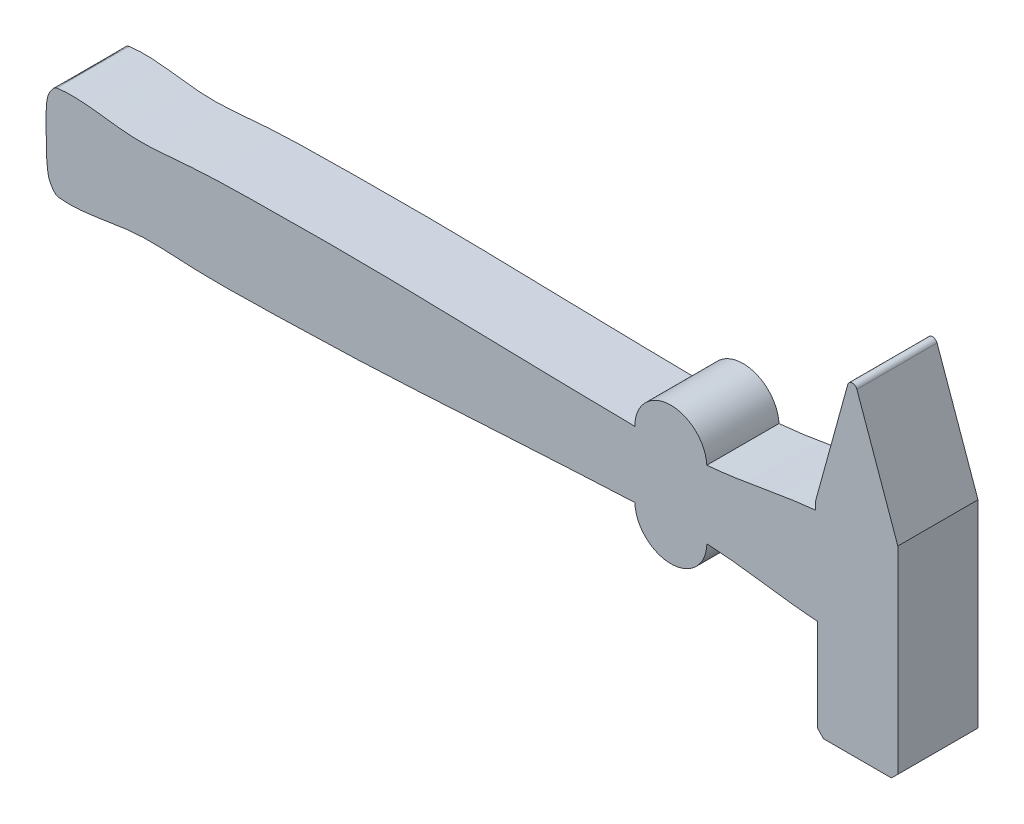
from build123d import *

# Parameters (mm, degrees)
BOSS_EXTRU_1_DEPTH      = 33.4
CONG_1_R                = 2
ENL_V_MAT_EXTRU_1_DEPTH = 3.33
BOSS_EXTRU_3_DEPTH      = 30.07


with BuildPart() as part:
    # Esquisse1 → Boss.-Extru.1 (new body)
    with BuildSketch(Plane.XY):
        with BuildLine():
            Line((0, 0), (0, 38.505510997))
            add(Edge.make_bspline(
                [(0, 38.505510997), (-12.992910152, 39.265137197), (-32.872622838, 43.172369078), (-62.322833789, 43.991821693), (-92.949048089, 42.495252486), (-137.627098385, 40.045196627), (-185.301385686, 37.015745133), (-228.892410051, 35.927652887), (-258.766698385, 35.321408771), (-283.178375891, 37.506686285), (-301.247067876, 33.550196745), (-312.011770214, 32.889647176), (-316.154687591, 33.365918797)],
                knots=[0, 0, 0, 0, 0.123173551, 0.190951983, 0.278444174, 0.413498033, 0.614695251, 0.730775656, 0.826275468, 0.89791465, 0.961054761, 1, 1, 1, 1], degree=3))
            add(Edge.make_bspline(
                [(-321.218635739, 52.813524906), (-321.20376202, 49.420119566), (-321.165898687, 44.191204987), (-320.287800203, 37.70671183), (-318.214716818, 34.690320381), (-316.906896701, 33.45239309), (-316.154687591, 33.365918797)],
                knots=[0, 0, 0, 0, 0.479345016, 0.759127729, 0.899247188, 1, 1, 1, 1], degree=3))
            add(Edge.make_bspline(
                [(-321.218635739, 52.813524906), (-321.320797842, 56.205424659), (-321.463284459, 61.43253465), (-320.809336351, 67.943453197), (-318.841511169, 71.029543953), (-317.577160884, 72.31183713), (-316.828381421, 72.424201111)],
                knots=[0, 0, 0, 0, 0.479345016, 0.759127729, 0.899247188, 1, 1, 1, 1], degree=3))
            add(Edge.make_bspline(
                [(-0.684508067, 78.190762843), (-13.643492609, 76.983507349), (-33.376632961, 72.393016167), (-62.781065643, 70.55841368), (-93.440673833, 70.997899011), (-138.176641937, 71.905703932), (-185.927046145, 73.289229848), (-229.529665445, 72.873369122), (-259.407090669, 72.448990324), (-283.728884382, 69.423137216), (-301.923274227, 72.75414573), (-312.704353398, 73.043064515), (-316.828381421, 72.424201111)],
                knots=[0, 0, 0, 0, 0.123173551, 0.190951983, 0.278444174, 0.413498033, 0.614695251, 0.730775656, 0.826275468, 0.89791465, 0.961054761, 1, 1, 1, 1], degree=3))
            Line((-0.684508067, 78.190762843), (-0.684508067, 81.696129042))
            Line((-0.684508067, 81.696129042), (14.354464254, 136.362398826))
            Line((14.354464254, 136.362398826), (33.528156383, 82.361170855))
            Line((33.528156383, 82.361170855), (33.528156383, 0))
            Line((33.528156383, 0), (30.828393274, -2.638829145))
            Line((30.828393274, -2.638829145), (2.579270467, -2.638829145))
            Line((2.579270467, -2.638829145), (0, 0))
        make_face()
    extrude(amount=BOSS_EXTRU_1_DEPTH)

    # Cong_1
    cong_1_edges = [part.edges().sort_by_distance(p)[0] for p in [
        (14.354464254, 136.362398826, 16.7),
    ]]
    fillet(cong_1_edges, radius=CONG_1_R)

    # Esquisse3 → Enl_v. mat.-Extru.1 (cut)
    with BuildSketch(Plane(origin=(0, 0, 0), x_dir=(-1, 0, 0), z_dir=(0, 0, -1))):
        with BuildLine():
            Line((0.684508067, 78.190762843), (0, 38.505510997))
            add(Edge.make_bspline(
                [(316.154687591, 33.365918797), (312.011770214, 32.889647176), (301.247067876, 33.550196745), (283.178375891, 37.506686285), (258.766698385, 35.321408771), (228.892410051, 35.927652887), (185.301385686, 37.015745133), (137.627098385, 40.045196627), (92.949048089, 42.495252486), (62.322833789, 43.991821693), (32.872622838, 43.172369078), (12.992910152, 39.265137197), (0, 38.505510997)],
                knots=[0, 0, 0, 0, 0.038945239, 0.10208535, 0.173724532, 0.269224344, 0.385304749, 0.586501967, 0.721555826, 0.809048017, 0.876826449, 1, 1, 1, 1], degree=3))
            add(Edge.make_bspline(
                [(321.218635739, 52.813524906), (321.20376202, 49.420119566), (321.165898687, 44.191204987), (320.287800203, 37.70671183), (318.214716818, 34.690320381), (316.906896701, 33.45239309), (316.154687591, 33.365918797)],
                knots=[0, 0, 0, 0, 0.479345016, 0.759127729, 0.899247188, 1, 1, 1, 1], degree=3))
            add(Edge.make_bspline(
                [(316.828381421, 72.424201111), (317.577160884, 72.31183713), (318.841511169, 71.029543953), (320.809336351, 67.943453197), (321.463284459, 61.43253465), (321.320797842, 56.205424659), (321.218635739, 52.813524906)],
                knots=[0, 0, 0, 0, 0.100752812, 0.240872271, 0.520654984, 1, 1, 1, 1], degree=3))
            add(Edge.make_bspline(
                [(0.684508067, 78.190762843), (13.643492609, 76.983507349), (33.376632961, 72.393016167), (62.781065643, 70.55841368), (93.440673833, 70.997899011), (138.176641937, 71.905703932), (185.927046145, 73.289229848), (229.529665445, 72.873369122), (259.407090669, 72.448990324), (283.728884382, 69.423137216), (301.923274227, 72.75414573), (312.704353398, 73.043064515), (316.828381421, 72.424201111)],
                knots=[0, 0, 0, 0, 0.123173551, 0.190951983, 0.278444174, 0.413498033, 0.614695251, 0.730775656, 0.826275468, 0.89791465, 0.961054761, 1, 1, 1, 1], degree=3))
        make_face()
    extrude(amount=-ENL_V_MAT_EXTRU_1_DEPTH, mode=Mode.SUBTRACT)

    # Esquisse5 → Boss.-Extru.3 (add)
    with BuildSketch(Plane.XY.offset(33.4)):
        with BuildLine():
            ThreePointArc((-46.033469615, 71.746234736), (-61.490139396, 85.911515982), (-76.010073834, 70.787517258))
            add(Edge.make_bspline(
                [(-46.033469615, 71.746234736), (-50.910466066, 71.323012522), (-60.908467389, 70.805098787), (-70.90658481, 70.754927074), (-76.010073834, 70.787517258)],
                knots=[0.144604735, 0.144604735, 0.144604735, 0.144604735, 0.190951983, 0.239280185, 0.239280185, 0.239280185, 0.239280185], degree=3))
        make_face()
        with BuildLine():
            ThreePointArc((-76.005273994, 43.287277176), (-60.951175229, 28.689019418), (-46.013315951, 43.406199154))
            add(Edge.make_bspline(
                [(-76.005273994, 43.287277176), (-70.749677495, 43.505862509), (-60.756025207, 43.807840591), (-50.746358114, 43.642350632), (-46.013315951, 43.406199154)],
                knots=[0.759237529, 0.759237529, 0.759237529, 0.759237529, 0.809048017, 0.853913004, 0.853913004, 0.853913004, 0.853913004], degree=3))
        make_face()
    extrude(amount=-BOSS_EXTRU_3_DEPTH)


solid = part.part
